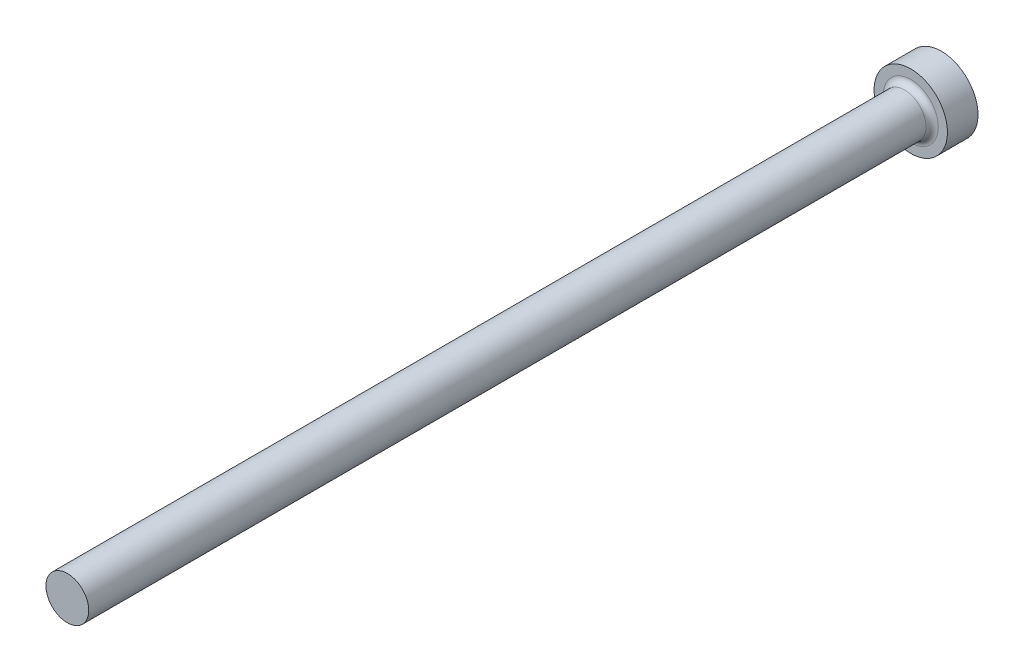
ISO-10303-21;
HEADER;
FILE_DESCRIPTION(('STEP AP214'),'2;1');
FILE_NAME('part.step','',(''),(''),'','','');
FILE_SCHEMA(('AUTOMOTIVE_DESIGN { 1 0 10303 214 1 1 1 1 }'));
ENDSEC;
DATA;
#1=APPLICATION_CONTEXT('core data for automotive mechanical design processes');
#2=APPLICATION_PROTOCOL_DEFINITION('international standard','automotive_design',2000,#1);
#3=PRODUCT_CONTEXT('',#1,'mechanical');
#4=PRODUCT('Part','Part','',(#3));
#5=PRODUCT_RELATED_PRODUCT_CATEGORY('part','',(#4));
#6=PRODUCT_DEFINITION_FORMATION('','',#4);
#7=PRODUCT_DEFINITION_CONTEXT('part definition',#1,'design');
#8=PRODUCT_DEFINITION('design','',#6,#7);
#9=PRODUCT_DEFINITION_SHAPE('','',#8);
#10=(LENGTH_UNIT() NAMED_UNIT(*) SI_UNIT(.MILLI.,.METRE.));
#11=(NAMED_UNIT(*) PLANE_ANGLE_UNIT() SI_UNIT($,.RADIAN.));
#12=(NAMED_UNIT(*) SI_UNIT($,.STERADIAN.) SOLID_ANGLE_UNIT());
#13=UNCERTAINTY_MEASURE_WITH_UNIT(LENGTH_MEASURE(1.E-05),#10,'distance_accuracy_value','');
#14=(GEOMETRIC_REPRESENTATION_CONTEXT(3) GLOBAL_UNCERTAINTY_ASSIGNED_CONTEXT((#13)) GLOBAL_UNIT_ASSIGNED_CONTEXT((#10,
#11,#12)) REPRESENTATION_CONTEXT('',''));
#15=CARTESIAN_POINT('',(0.,0.,0.));
#16=DIRECTION('',(0.,0.,1.));
#17=DIRECTION('',(1.,0.,0.));
#18=AXIS2_PLACEMENT_3D('',#15,#16,#17);
#19=CARTESIAN_POINT('',(-8.33773216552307E-06,35.085,-138.));
#20=DIRECTION('',(0.,0.,1.));
#21=DIRECTION('',(1.,0.,0.));
#22=AXIS2_PLACEMENT_3D('',#19,#20,#21);
#23=PLANE('',#22);
#24=CARTESIAN_POINT('',(-8.33773216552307E-06,35.085,-138.));
#25=DIRECTION('',(0.,0.,1.));
#26=DIRECTION('',(1.,0.,0.));
#27=AXIS2_PLACEMENT_3D('',#24,#25,#26);
#28=CIRCLE('',#27,4.5);
#29=CARTESIAN_POINT('',(4.49999166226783,35.085,-138.));
#30=VERTEX_POINT('',#29);
#31=EDGE_CURVE('E37',#30,#30,#28,.F.);
#32=ORIENTED_EDGE('',*,*,#31,.T.);
#33=EDGE_LOOP('',(#32));
#34=FACE_BOUND('',#33,.T.);
#35=CARTESIAN_POINT('',(-8.33773216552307E-06,35.085,-138.));
#36=DIRECTION('',(0.,0.,1.));
#37=DIRECTION('',(1.,0.,0.));
#38=AXIS2_PLACEMENT_3D('',#35,#36,#37);
#39=CIRCLE('',#38,6.);
#40=CARTESIAN_POINT('',(5.99999166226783,35.085,-138.));
#41=VERTEX_POINT('',#40);
#42=EDGE_CURVE('E41',#41,#41,#39,.T.);
#43=ORIENTED_EDGE('',*,*,#42,.T.);
#44=EDGE_LOOP('',(#43));
#45=FACE_BOUND('',#44,.T.);
#46=ADVANCED_FACE('F30',(#34,#45),#23,.T.);
#47=CARTESIAN_POINT('',(-8.33773216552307E-06,35.085,-138.));
#48=DIRECTION('',(0.,0.,-1.));
#49=DIRECTION('',(-1.,0.,0.));
#50=AXIS2_PLACEMENT_3D('',#47,#48,#49);
#51=CYLINDRICAL_SURFACE('',#50,6.);
#52=ORIENTED_EDGE('',*,*,#42,.F.);
#53=EDGE_LOOP('',(#52));
#54=FACE_BOUND('',#53,.T.);
#55=CARTESIAN_POINT('',(-8.33773216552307E-06,35.085,-143.));
#56=DIRECTION('',(0.,0.,1.));
#57=DIRECTION('',(1.,0.,0.));
#58=AXIS2_PLACEMENT_3D('',#55,#56,#57);
#59=CIRCLE('',#58,6.);
#60=CARTESIAN_POINT('',(5.99999166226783,35.085,-143.));
#61=VERTEX_POINT('',#60);
#62=EDGE_CURVE('E45',#61,#61,#59,.T.);
#63=ORIENTED_EDGE('',*,*,#62,.T.);
#64=EDGE_LOOP('',(#63));
#65=FACE_BOUND('',#64,.T.);
#66=ADVANCED_FACE('F65',(#54,#65),#51,.T.);
#67=CARTESIAN_POINT('',(-8.33773216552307E-06,35.085,-143.));
#68=DIRECTION('',(0.,0.,1.));
#69=DIRECTION('',(1.,0.,0.));
#70=AXIS2_PLACEMENT_3D('',#67,#68,#69);
#71=PLANE('',#70);
#72=ORIENTED_EDGE('',*,*,#62,.F.);
#73=EDGE_LOOP('',(#72));
#74=FACE_BOUND('',#73,.T.);
#75=ADVANCED_FACE('F58',(#74),#71,.F.);
#76=CARTESIAN_POINT('',(-8.33773216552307E-06,35.085,-147.899494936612));
#77=DIRECTION('',(0.,0.,1.));
#78=DIRECTION('',(1.,0.,0.));
#79=AXIS2_PLACEMENT_3D('',#76,#77,#78);
#80=CYLINDRICAL_SURFACE('',#79,3.5);
#81=CARTESIAN_POINT('',(-8.33773216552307E-06,35.085,-137.));
#82=DIRECTION('',(0.,0.,1.));
#83=DIRECTION('',(1.,0.,0.));
#84=AXIS2_PLACEMENT_3D('',#81,#82,#83);
#85=CIRCLE('',#84,3.5);
#86=CARTESIAN_POINT('',(3.49999166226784,35.085,-137.));
#87=VERTEX_POINT('',#86);
#88=EDGE_CURVE('E10',#87,#87,#85,.T.);
#89=ORIENTED_EDGE('',*,*,#88,.T.);
#90=EDGE_LOOP('',(#89));
#91=FACE_BOUND('',#90,.T.);
#92=CARTESIAN_POINT('',(-8.33773216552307E-06,35.085,0.000399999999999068));
#93=DIRECTION('',(0.,0.,1.));
#94=DIRECTION('',(1.,0.,0.));
#95=AXIS2_PLACEMENT_3D('',#92,#93,#94);
#96=CIRCLE('',#95,3.5);
#97=CARTESIAN_POINT('',(3.49999166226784,35.085,0.000399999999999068));
#98=VERTEX_POINT('',#97);
#99=EDGE_CURVE('E49',#98,#98,#96,.T.);
#100=ORIENTED_EDGE('',*,*,#99,.F.);
#101=EDGE_LOOP('',(#100));
#102=FACE_BOUND('',#101,.T.);
#103=ADVANCED_FACE('F56',(#91,#102),#80,.T.);
#104=CARTESIAN_POINT('',(-8.33773216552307E-06,35.085,0.000399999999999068));
#105=DIRECTION('',(0.,0.,-1.));
#106=DIRECTION('',(-1.,0.,0.));
#107=AXIS2_PLACEMENT_3D('',#104,#105,#106);
#108=PLANE('',#107);
#109=ORIENTED_EDGE('',*,*,#99,.T.);
#110=EDGE_LOOP('',(#109));
#111=FACE_BOUND('',#110,.T.);
#112=ADVANCED_FACE('F54',(#111),#108,.F.);
#113=CARTESIAN_POINT('',(-8.33773216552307E-06,35.085,-137.));
#114=DIRECTION('',(0.,0.,1.));
#115=DIRECTION('',(1.,0.,0.));
#116=AXIS2_PLACEMENT_3D('',#113,#114,#115);
#117=TOROIDAL_SURFACE('',#116,4.5,1.);
#118=ORIENTED_EDGE('',*,*,#88,.F.);
#119=EDGE_LOOP('',(#118));
#120=FACE_BOUND('',#119,.T.);
#121=ORIENTED_EDGE('',*,*,#31,.F.);
#122=EDGE_LOOP('',(#121));
#123=FACE_BOUND('',#122,.T.);
#124=ADVANCED_FACE('F32',(#120,#123),#117,.F.);
#125=CLOSED_SHELL('',(#46,#66,#75,#103,#112,#124));
#126=MANIFOLD_SOLID_BREP('B2',#125);
#127=ADVANCED_BREP_SHAPE_REPRESENTATION('',(#18,#126),#14);
#128=SHAPE_DEFINITION_REPRESENTATION(#9,#127);
ENDSEC;
END-ISO-10303-21;
